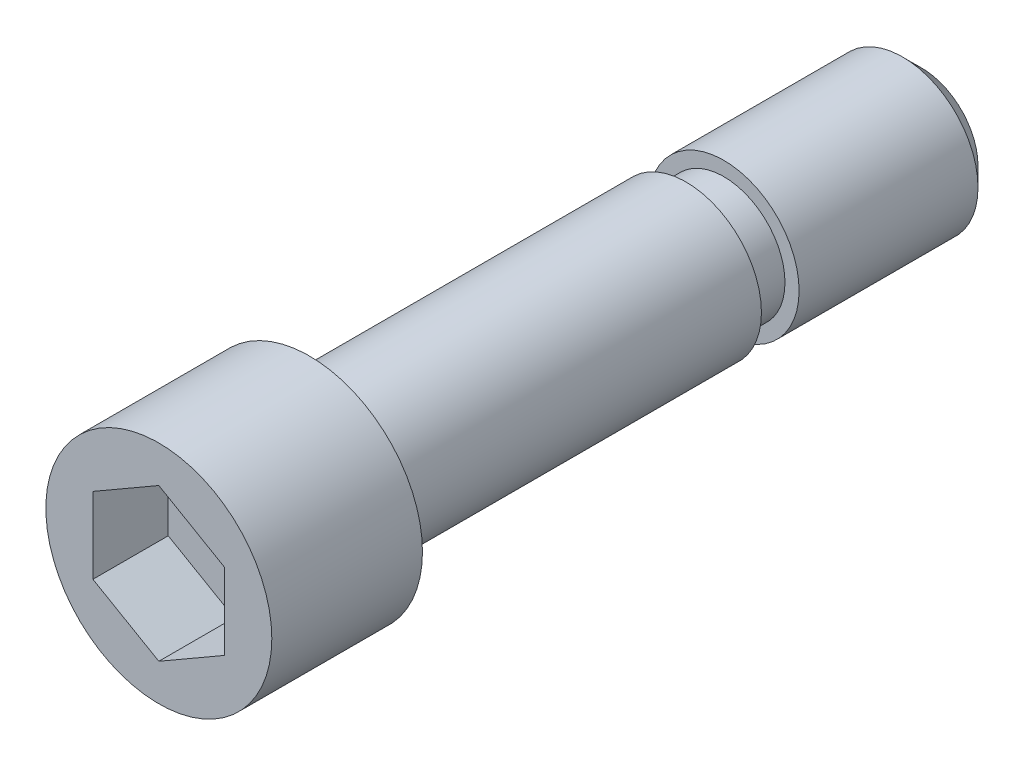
ISO-10303-21;
HEADER;
FILE_DESCRIPTION(('STEP AP214'),'2;1');
FILE_NAME('part.step','',(''),(''),'','','');
FILE_SCHEMA(('AUTOMOTIVE_DESIGN { 1 0 10303 214 1 1 1 1 }'));
ENDSEC;
DATA;
#1=APPLICATION_CONTEXT('core data for automotive mechanical design processes');
#2=APPLICATION_PROTOCOL_DEFINITION('international standard','automotive_design',2000,#1);
#3=PRODUCT_CONTEXT('',#1,'mechanical');
#4=PRODUCT('Part','Part','',(#3));
#5=PRODUCT_RELATED_PRODUCT_CATEGORY('part','',(#4));
#6=PRODUCT_DEFINITION_FORMATION('','',#4);
#7=PRODUCT_DEFINITION_CONTEXT('part definition',#1,'design');
#8=PRODUCT_DEFINITION('design','',#6,#7);
#9=PRODUCT_DEFINITION_SHAPE('','',#8);
#10=(LENGTH_UNIT() NAMED_UNIT(*) SI_UNIT(.MILLI.,.METRE.));
#11=(NAMED_UNIT(*) PLANE_ANGLE_UNIT() SI_UNIT($,.RADIAN.));
#12=(NAMED_UNIT(*) SI_UNIT($,.STERADIAN.) SOLID_ANGLE_UNIT());
#13=UNCERTAINTY_MEASURE_WITH_UNIT(LENGTH_MEASURE(1.E-05),#10,'distance_accuracy_value','');
#14=(GEOMETRIC_REPRESENTATION_CONTEXT(3) GLOBAL_UNCERTAINTY_ASSIGNED_CONTEXT((#13)) GLOBAL_UNIT_ASSIGNED_CONTEXT((#10,
#11,#12)) REPRESENTATION_CONTEXT('',''));
#15=CARTESIAN_POINT('',(0.,0.,0.));
#16=DIRECTION('',(0.,0.,1.));
#17=DIRECTION('',(1.,0.,0.));
#18=AXIS2_PLACEMENT_3D('',#15,#16,#17);
#19=CARTESIAN_POINT('',(-12.,0.,16.));
#20=DIRECTION('',(0.,0.,-1.));
#21=DIRECTION('',(-1.,0.,0.));
#22=AXIS2_PLACEMENT_3D('',#19,#20,#21);
#23=PLANE('',#22);
#24=DIRECTION('',(-0.866025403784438,-0.5,0.));
#25=VECTOR('',#24,1.);
#26=CARTESIAN_POINT('',(0.,8.08290376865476,16.));
#27=LINE('',#26,#25);
#28=CARTESIAN_POINT('',(0.,8.08290376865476,16.));
#29=VERTEX_POINT('',#28);
#30=CARTESIAN_POINT('',(-7.,4.04145188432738,16.));
#31=VERTEX_POINT('',#30);
#32=EDGE_CURVE('E82',#29,#31,#27,.T.);
#33=ORIENTED_EDGE('',*,*,#32,.F.);
#34=DIRECTION('',(-0.866025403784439,0.5,0.));
#35=VECTOR('',#34,1.);
#36=CARTESIAN_POINT('',(7.,4.04145188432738,16.));
#37=LINE('',#36,#35);
#38=CARTESIAN_POINT('',(7.,4.04145188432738,16.));
#39=VERTEX_POINT('',#38);
#40=EDGE_CURVE('E28',#39,#29,#37,.T.);
#41=ORIENTED_EDGE('',*,*,#40,.F.);
#42=DIRECTION('',(0.,1.,0.));
#43=VECTOR('',#42,1.);
#44=CARTESIAN_POINT('',(7.,-4.04145188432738,16.));
#45=LINE('',#44,#43);
#46=CARTESIAN_POINT('',(7.,-4.04145188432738,16.));
#47=VERTEX_POINT('',#46);
#48=EDGE_CURVE('E97',#47,#39,#45,.T.);
#49=ORIENTED_EDGE('',*,*,#48,.F.);
#50=DIRECTION('',(0.866025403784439,0.5,0.));
#51=VECTOR('',#50,1.);
#52=CARTESIAN_POINT('',(0.,-8.08290376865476,16.));
#53=LINE('',#52,#51);
#54=CARTESIAN_POINT('',(0.,-8.08290376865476,16.));
#55=VERTEX_POINT('',#54);
#56=EDGE_CURVE('E91',#55,#47,#53,.T.);
#57=ORIENTED_EDGE('',*,*,#56,.F.);
#58=DIRECTION('',(0.866025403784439,-0.5,0.));
#59=VECTOR('',#58,1.);
#60=CARTESIAN_POINT('',(-7.,-4.04145188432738,16.));
#61=LINE('',#60,#59);
#62=CARTESIAN_POINT('',(-7.,-4.04145188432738,16.));
#63=VERTEX_POINT('',#62);
#64=EDGE_CURVE('E89',#63,#55,#61,.T.);
#65=ORIENTED_EDGE('',*,*,#64,.F.);
#66=DIRECTION('',(0.,-1.,0.));
#67=VECTOR('',#66,1.);
#68=CARTESIAN_POINT('',(-7.,4.04145188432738,16.));
#69=LINE('',#68,#67);
#70=EDGE_CURVE('E71',#31,#63,#69,.T.);
#71=ORIENTED_EDGE('',*,*,#70,.F.);
#72=EDGE_LOOP('',(#33,#41,#49,#57,#65,#71));
#73=FACE_BOUND('',#72,.T.);
#74=CARTESIAN_POINT('',(0.,0.,16.));
#75=DIRECTION('',(0.,0.,1.));
#76=DIRECTION('',(1.,0.,0.));
#77=AXIS2_PLACEMENT_3D('',#74,#75,#76);
#78=CIRCLE('',#77,12.);
#79=CARTESIAN_POINT('',(12.,0.,16.));
#80=VERTEX_POINT('',#79);
#81=EDGE_CURVE('E9',#80,#80,#78,.T.);
#82=ORIENTED_EDGE('',*,*,#81,.T.);
#83=EDGE_LOOP('',(#82));
#84=FACE_BOUND('',#83,.T.);
#85=ADVANCED_FACE('F14',(#73,#84),#23,.F.);
#86=CARTESIAN_POINT('',(0.,0.,15.));
#87=DIRECTION('',(0.,0.,1.));
#88=DIRECTION('',(1.,0.,0.));
#89=AXIS2_PLACEMENT_3D('',#86,#87,#88);
#90=CYLINDRICAL_SURFACE('',#89,12.);
#91=ORIENTED_EDGE('',*,*,#81,.F.);
#92=EDGE_LOOP('',(#91));
#93=FACE_BOUND('',#92,.T.);
#94=CARTESIAN_POINT('',(0.,0.,0.));
#95=DIRECTION('',(0.,0.,1.));
#96=DIRECTION('',(1.,0.,0.));
#97=AXIS2_PLACEMENT_3D('',#94,#95,#96);
#98=CIRCLE('',#97,12.);
#99=CARTESIAN_POINT('',(12.,0.,0.));
#100=VERTEX_POINT('',#99);
#101=EDGE_CURVE('E21',#100,#100,#98,.T.);
#102=ORIENTED_EDGE('',*,*,#101,.T.);
#103=EDGE_LOOP('',(#102));
#104=FACE_BOUND('',#103,.T.);
#105=ADVANCED_FACE('F144',(#93,#104),#90,.T.);
#106=CARTESIAN_POINT('',(-8.,0.,0.));
#107=DIRECTION('',(0.,0.,1.));
#108=DIRECTION('',(1.,0.,0.));
#109=AXIS2_PLACEMENT_3D('',#106,#107,#108);
#110=PLANE('',#109);
#111=ORIENTED_EDGE('',*,*,#101,.F.);
#112=EDGE_LOOP('',(#111));
#113=FACE_BOUND('',#112,.T.);
#114=CARTESIAN_POINT('',(0.,0.,0.));
#115=DIRECTION('',(0.,0.,1.));
#116=DIRECTION('',(1.,0.,0.));
#117=AXIS2_PLACEMENT_3D('',#114,#115,#116);
#118=CIRCLE('',#117,8.);
#119=CARTESIAN_POINT('',(8.,0.,0.));
#120=VERTEX_POINT('',#119);
#121=EDGE_CURVE('E139',#120,#120,#118,.T.);
#122=ORIENTED_EDGE('',*,*,#121,.T.);
#123=EDGE_LOOP('',(#122));
#124=FACE_BOUND('',#123,.T.);
#125=ADVANCED_FACE('F146',(#113,#124),#110,.F.);
#126=CARTESIAN_POINT('',(0.,0.,15.));
#127=DIRECTION('',(0.,0.,1.));
#128=DIRECTION('',(1.,0.,0.));
#129=AXIS2_PLACEMENT_3D('',#126,#127,#128);
#130=CYLINDRICAL_SURFACE('',#129,8.);
#131=ORIENTED_EDGE('',*,*,#121,.F.);
#132=EDGE_LOOP('',(#131));
#133=FACE_BOUND('',#132,.T.);
#134=CARTESIAN_POINT('',(0.,0.,-40.));
#135=DIRECTION('',(0.,0.,1.));
#136=DIRECTION('',(1.,0.,0.));
#137=AXIS2_PLACEMENT_3D('',#134,#135,#136);
#138=CIRCLE('',#137,8.);
#139=CARTESIAN_POINT('',(8.,0.,-40.));
#140=VERTEX_POINT('',#139);
#141=EDGE_CURVE('E136',#140,#140,#138,.T.);
#142=ORIENTED_EDGE('',*,*,#141,.T.);
#143=EDGE_LOOP('',(#142));
#144=FACE_BOUND('',#143,.T.);
#145=ADVANCED_FACE('F149',(#133,#144),#130,.T.);
#146=CARTESIAN_POINT('',(-6.5,0.,-40.));
#147=DIRECTION('',(0.,0.,1.));
#148=DIRECTION('',(1.,0.,0.));
#149=AXIS2_PLACEMENT_3D('',#146,#147,#148);
#150=PLANE('',#149);
#151=ORIENTED_EDGE('',*,*,#141,.F.);
#152=EDGE_LOOP('',(#151));
#153=FACE_BOUND('',#152,.T.);
#154=CARTESIAN_POINT('',(0.,0.,-40.));
#155=DIRECTION('',(0.,0.,1.));
#156=DIRECTION('',(1.,0.,0.));
#157=AXIS2_PLACEMENT_3D('',#154,#155,#156);
#158=CIRCLE('',#157,6.5);
#159=CARTESIAN_POINT('',(6.5,0.,-40.));
#160=VERTEX_POINT('',#159);
#161=EDGE_CURVE('E133',#160,#160,#158,.T.);
#162=ORIENTED_EDGE('',*,*,#161,.T.);
#163=EDGE_LOOP('',(#162));
#164=FACE_BOUND('',#163,.T.);
#165=ADVANCED_FACE('F155',(#153,#164),#150,.F.);
#166=CARTESIAN_POINT('',(0.,0.,15.));
#167=DIRECTION('',(0.,0.,1.));
#168=DIRECTION('',(1.,0.,0.));
#169=AXIS2_PLACEMENT_3D('',#166,#167,#168);
#170=CYLINDRICAL_SURFACE('',#169,6.5);
#171=ORIENTED_EDGE('',*,*,#161,.F.);
#172=EDGE_LOOP('',(#171));
#173=FACE_BOUND('',#172,.T.);
#174=CARTESIAN_POINT('',(0.,0.,-44.));
#175=DIRECTION('',(0.,0.,1.));
#176=DIRECTION('',(1.,0.,0.));
#177=AXIS2_PLACEMENT_3D('',#174,#175,#176);
#178=CIRCLE('',#177,6.5);
#179=CARTESIAN_POINT('',(6.5,0.,-44.));
#180=VERTEX_POINT('',#179);
#181=EDGE_CURVE('E130',#180,#180,#178,.T.);
#182=ORIENTED_EDGE('',*,*,#181,.T.);
#183=EDGE_LOOP('',(#182));
#184=FACE_BOUND('',#183,.T.);
#185=ADVANCED_FACE('F161',(#173,#184),#170,.T.);
#186=CARTESIAN_POINT('',(-8.,0.,-44.));
#187=DIRECTION('',(0.,0.,-1.));
#188=DIRECTION('',(-1.,0.,0.));
#189=AXIS2_PLACEMENT_3D('',#186,#187,#188);
#190=PLANE('',#189);
#191=ORIENTED_EDGE('',*,*,#181,.F.);
#192=EDGE_LOOP('',(#191));
#193=FACE_BOUND('',#192,.T.);
#194=CARTESIAN_POINT('',(0.,0.,-44.));
#195=DIRECTION('',(0.,0.,1.));
#196=DIRECTION('',(1.,0.,0.));
#197=AXIS2_PLACEMENT_3D('',#194,#195,#196);
#198=CIRCLE('',#197,8.);
#199=CARTESIAN_POINT('',(8.,0.,-44.));
#200=VERTEX_POINT('',#199);
#201=EDGE_CURVE('E127',#200,#200,#198,.T.);
#202=ORIENTED_EDGE('',*,*,#201,.T.);
#203=EDGE_LOOP('',(#202));
#204=FACE_BOUND('',#203,.T.);
#205=ADVANCED_FACE('F167',(#193,#204),#190,.F.);
#206=CARTESIAN_POINT('',(0.,0.,15.));
#207=DIRECTION('',(0.,0.,1.));
#208=DIRECTION('',(1.,0.,0.));
#209=AXIS2_PLACEMENT_3D('',#206,#207,#208);
#210=CYLINDRICAL_SURFACE('',#209,8.);
#211=ORIENTED_EDGE('',*,*,#201,.F.);
#212=EDGE_LOOP('',(#211));
#213=FACE_BOUND('',#212,.T.);
#214=CARTESIAN_POINT('',(0.,0.,-63.));
#215=DIRECTION('',(0.,0.,1.));
#216=DIRECTION('',(1.,0.,0.));
#217=AXIS2_PLACEMENT_3D('',#214,#215,#216);
#218=CIRCLE('',#217,8.);
#219=CARTESIAN_POINT('',(8.,0.,-63.));
#220=VERTEX_POINT('',#219);
#221=EDGE_CURVE('E124',#220,#220,#218,.T.);
#222=ORIENTED_EDGE('',*,*,#221,.T.);
#223=EDGE_LOOP('',(#222));
#224=FACE_BOUND('',#223,.T.);
#225=ADVANCED_FACE('F173',(#213,#224),#210,.T.);
#226=CARTESIAN_POINT('',(0.,0.,-65.));
#227=DIRECTION('',(0.,0.,1.));
#228=DIRECTION('',(1.,0.,0.));
#229=AXIS2_PLACEMENT_3D('',#226,#227,#228);
#230=CONICAL_SURFACE('',#229,6.,0.785398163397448);
#231=ORIENTED_EDGE('',*,*,#221,.F.);
#232=EDGE_LOOP('',(#231));
#233=FACE_BOUND('',#232,.T.);
#234=CARTESIAN_POINT('',(0.,0.,-65.));
#235=DIRECTION('',(0.,0.,1.));
#236=DIRECTION('',(1.,0.,0.));
#237=AXIS2_PLACEMENT_3D('',#234,#235,#236);
#238=CIRCLE('',#237,6.);
#239=CARTESIAN_POINT('',(6.,0.,-65.));
#240=VERTEX_POINT('',#239);
#241=EDGE_CURVE('E115',#240,#240,#238,.T.);
#242=ORIENTED_EDGE('',*,*,#241,.T.);
#243=EDGE_LOOP('',(#242));
#244=FACE_BOUND('',#243,.T.);
#245=ADVANCED_FACE('F179',(#233,#244),#230,.T.);
#246=CARTESIAN_POINT('',(0.,0.,-65.));
#247=DIRECTION('',(0.,0.,1.));
#248=DIRECTION('',(1.,0.,0.));
#249=AXIS2_PLACEMENT_3D('',#246,#247,#248);
#250=PLANE('',#249);
#251=ORIENTED_EDGE('',*,*,#241,.F.);
#252=EDGE_LOOP('',(#251));
#253=FACE_BOUND('',#252,.T.);
#254=ADVANCED_FACE('F185',(#253),#250,.F.);
#255=CARTESIAN_POINT('',(7.,4.04145188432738,8.));
#256=DIRECTION('',(0.5,0.866025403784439,0.));
#257=DIRECTION('',(-0.866025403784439,0.5,0.));
#258=AXIS2_PLACEMENT_3D('',#255,#256,#257);
#259=PLANE('',#258);
#260=ORIENTED_EDGE('',*,*,#40,.T.);
#261=DIRECTION('',(0.,0.,1.));
#262=VECTOR('',#261,1.);
#263=CARTESIAN_POINT('',(0.,8.08290376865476,8.));
#264=LINE('',#263,#262);
#265=CARTESIAN_POINT('',(0.,8.08290376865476,8.));
#266=VERTEX_POINT('',#265);
#267=EDGE_CURVE('E79',#266,#29,#264,.T.);
#268=ORIENTED_EDGE('',*,*,#267,.F.);
#269=DIRECTION('',(-0.866025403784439,0.5,0.));
#270=VECTOR('',#269,1.);
#271=CARTESIAN_POINT('',(7.,4.04145188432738,8.));
#272=LINE('',#271,#270);
#273=CARTESIAN_POINT('',(7.,4.04145188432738,8.));
#274=VERTEX_POINT('',#273);
#275=EDGE_CURVE('E99',#274,#266,#272,.T.);
#276=ORIENTED_EDGE('',*,*,#275,.F.);
#277=DIRECTION('',(0.,0.,1.));
#278=VECTOR('',#277,1.);
#279=CARTESIAN_POINT('',(7.,4.04145188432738,8.));
#280=LINE('',#279,#278);
#281=EDGE_CURVE('E35',#274,#39,#280,.T.);
#282=ORIENTED_EDGE('',*,*,#281,.T.);
#283=EDGE_LOOP('',(#260,#268,#276,#282));
#284=FACE_BOUND('',#283,.T.);
#285=ADVANCED_FACE('F190',(#284),#259,.F.);
#286=CARTESIAN_POINT('',(7.,-4.04145188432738,8.));
#287=DIRECTION('',(1.,0.,0.));
#288=DIRECTION('',(0.,1.,0.));
#289=AXIS2_PLACEMENT_3D('',#286,#287,#288);
#290=PLANE('',#289);
#291=ORIENTED_EDGE('',*,*,#48,.T.);
#292=ORIENTED_EDGE('',*,*,#281,.F.);
#293=DIRECTION('',(0.,1.,0.));
#294=VECTOR('',#293,1.);
#295=CARTESIAN_POINT('',(7.,-4.04145188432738,8.));
#296=LINE('',#295,#294);
#297=CARTESIAN_POINT('',(7.,-4.04145188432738,8.));
#298=VERTEX_POINT('',#297);
#299=EDGE_CURVE('E111',#298,#274,#296,.T.);
#300=ORIENTED_EDGE('',*,*,#299,.F.);
#301=DIRECTION('',(0.,0.,1.));
#302=VECTOR('',#301,1.);
#303=CARTESIAN_POINT('',(7.,-4.04145188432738,8.));
#304=LINE('',#303,#302);
#305=EDGE_CURVE('E116',#298,#47,#304,.T.);
#306=ORIENTED_EDGE('',*,*,#305,.T.);
#307=EDGE_LOOP('',(#291,#292,#300,#306));
#308=FACE_BOUND('',#307,.T.);
#309=ADVANCED_FACE('F196',(#308),#290,.F.);
#310=CARTESIAN_POINT('',(0.,-8.08290376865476,8.));
#311=DIRECTION('',(0.5,-0.866025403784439,0.));
#312=DIRECTION('',(0.866025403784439,0.5,0.));
#313=AXIS2_PLACEMENT_3D('',#310,#311,#312);
#314=PLANE('',#313);
#315=ORIENTED_EDGE('',*,*,#56,.T.);
#316=ORIENTED_EDGE('',*,*,#305,.F.);
#317=DIRECTION('',(0.866025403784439,0.5,0.));
#318=VECTOR('',#317,1.);
#319=CARTESIAN_POINT('',(0.,-8.08290376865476,8.));
#320=LINE('',#319,#318);
#321=CARTESIAN_POINT('',(0.,-8.08290376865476,8.));
#322=VERTEX_POINT('',#321);
#323=EDGE_CURVE('E108',#322,#298,#320,.T.);
#324=ORIENTED_EDGE('',*,*,#323,.F.);
#325=DIRECTION('',(0.,0.,1.));
#326=VECTOR('',#325,1.);
#327=CARTESIAN_POINT('',(0.,-8.08290376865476,8.));
#328=LINE('',#327,#326);
#329=EDGE_CURVE('E118',#322,#55,#328,.T.);
#330=ORIENTED_EDGE('',*,*,#329,.T.);
#331=EDGE_LOOP('',(#315,#316,#324,#330));
#332=FACE_BOUND('',#331,.T.);
#333=ADVANCED_FACE('F267',(#332),#314,.F.);
#334=CARTESIAN_POINT('',(-7.,-4.04145188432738,8.));
#335=DIRECTION('',(-0.5,-0.866025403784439,0.));
#336=DIRECTION('',(0.866025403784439,-0.5,0.));
#337=AXIS2_PLACEMENT_3D('',#334,#335,#336);
#338=PLANE('',#337);
#339=ORIENTED_EDGE('',*,*,#64,.T.);
#340=ORIENTED_EDGE('',*,*,#329,.F.);
#341=DIRECTION('',(0.866025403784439,-0.5,0.));
#342=VECTOR('',#341,1.);
#343=CARTESIAN_POINT('',(-7.,-4.04145188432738,8.));
#344=LINE('',#343,#342);
#345=CARTESIAN_POINT('',(-7.,-4.04145188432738,8.));
#346=VERTEX_POINT('',#345);
#347=EDGE_CURVE('E105',#346,#322,#344,.T.);
#348=ORIENTED_EDGE('',*,*,#347,.F.);
#349=DIRECTION('',(0.,0.,1.));
#350=VECTOR('',#349,1.);
#351=CARTESIAN_POINT('',(-7.,-4.04145188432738,8.));
#352=LINE('',#351,#350);
#353=EDGE_CURVE('E78',#346,#63,#352,.T.);
#354=ORIENTED_EDGE('',*,*,#353,.T.);
#355=EDGE_LOOP('',(#339,#340,#348,#354));
#356=FACE_BOUND('',#355,.T.);
#357=ADVANCED_FACE('F276',(#356),#338,.F.);
#358=CARTESIAN_POINT('',(-7.,4.04145188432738,8.));
#359=DIRECTION('',(-1.,0.,0.));
#360=DIRECTION('',(0.,-1.,0.));
#361=AXIS2_PLACEMENT_3D('',#358,#359,#360);
#362=PLANE('',#361);
#363=ORIENTED_EDGE('',*,*,#70,.T.);
#364=ORIENTED_EDGE('',*,*,#353,.F.);
#365=DIRECTION('',(0.,-1.,0.));
#366=VECTOR('',#365,1.);
#367=CARTESIAN_POINT('',(-7.,4.04145188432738,8.));
#368=LINE('',#367,#366);
#369=CARTESIAN_POINT('',(-7.,4.04145188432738,8.));
#370=VERTEX_POINT('',#369);
#371=EDGE_CURVE('E74',#370,#346,#368,.T.);
#372=ORIENTED_EDGE('',*,*,#371,.F.);
#373=DIRECTION('',(0.,0.,1.));
#374=VECTOR('',#373,1.);
#375=CARTESIAN_POINT('',(-7.,4.04145188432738,8.));
#376=LINE('',#375,#374);
#377=EDGE_CURVE('E67',#370,#31,#376,.T.);
#378=ORIENTED_EDGE('',*,*,#377,.T.);
#379=EDGE_LOOP('',(#363,#364,#372,#378));
#380=FACE_BOUND('',#379,.T.);
#381=ADVANCED_FACE('F69',(#380),#362,.F.);
#382=CARTESIAN_POINT('',(0.,8.08290376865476,8.));
#383=DIRECTION('',(-0.5,0.866025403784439,0.));
#384=DIRECTION('',(-0.866025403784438,-0.5,0.));
#385=AXIS2_PLACEMENT_3D('',#382,#383,#384);
#386=PLANE('',#385);
#387=ORIENTED_EDGE('',*,*,#32,.T.);
#388=ORIENTED_EDGE('',*,*,#377,.F.);
#389=DIRECTION('',(-0.866025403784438,-0.5,0.));
#390=VECTOR('',#389,1.);
#391=CARTESIAN_POINT('',(0.,8.08290376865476,8.));
#392=LINE('',#391,#390);
#393=EDGE_CURVE('E102',#266,#370,#392,.T.);
#394=ORIENTED_EDGE('',*,*,#393,.F.);
#395=ORIENTED_EDGE('',*,*,#267,.T.);
#396=EDGE_LOOP('',(#387,#388,#394,#395));
#397=FACE_BOUND('',#396,.T.);
#398=ADVANCED_FACE('F83',(#397),#386,.F.);
#399=CARTESIAN_POINT('',(-7.,12.1243556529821,8.));
#400=DIRECTION('',(0.,0.,1.));
#401=DIRECTION('',(1.,0.,0.));
#402=AXIS2_PLACEMENT_3D('',#399,#400,#401);
#403=PLANE('',#402);
#404=ORIENTED_EDGE('',*,*,#275,.T.);
#405=ORIENTED_EDGE('',*,*,#393,.T.);
#406=ORIENTED_EDGE('',*,*,#371,.T.);
#407=ORIENTED_EDGE('',*,*,#347,.T.);
#408=ORIENTED_EDGE('',*,*,#323,.T.);
#409=ORIENTED_EDGE('',*,*,#299,.T.);
#410=EDGE_LOOP('',(#404,#405,#406,#407,#408,#409));
#411=FACE_BOUND('',#410,.T.);
#412=ADVANCED_FACE('F303',(#411),#403,.T.);
#413=CLOSED_SHELL('',(#85,#105,#125,#145,#165,#185,#205,#225,#245,#254,#285,#309,#333,#357,#381,
#398,#412));
#414=MANIFOLD_SOLID_BREP('B1',#413);
#415=ADVANCED_BREP_SHAPE_REPRESENTATION('',(#18,#414),#14);
#416=SHAPE_DEFINITION_REPRESENTATION(#9,#415);
ENDSEC;
END-ISO-10303-21;
